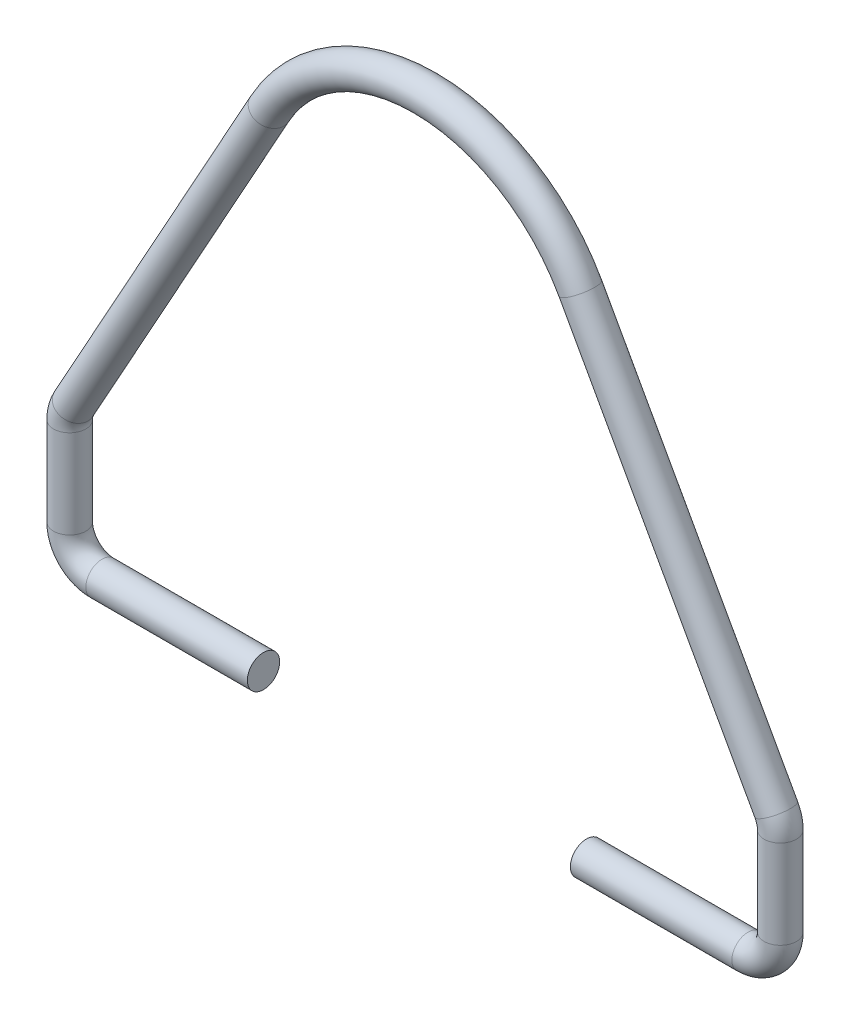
ISO-10303-21;
HEADER;
FILE_DESCRIPTION(('STEP AP214'),'2;1');
FILE_NAME('part.step','',(''),(''),'','','');
FILE_SCHEMA(('AUTOMOTIVE_DESIGN { 1 0 10303 214 1 1 1 1 }'));
ENDSEC;
DATA;
#1=APPLICATION_CONTEXT('core data for automotive mechanical design processes');
#2=APPLICATION_PROTOCOL_DEFINITION('international standard','automotive_design',2000,#1);
#3=PRODUCT_CONTEXT('',#1,'mechanical');
#4=PRODUCT('Part','Part','',(#3));
#5=PRODUCT_RELATED_PRODUCT_CATEGORY('part','',(#4));
#6=PRODUCT_DEFINITION_FORMATION('','',#4);
#7=PRODUCT_DEFINITION_CONTEXT('part definition',#1,'design');
#8=PRODUCT_DEFINITION('design','',#6,#7);
#9=PRODUCT_DEFINITION_SHAPE('','',#8);
#10=(LENGTH_UNIT() NAMED_UNIT(*) SI_UNIT(.MILLI.,.METRE.));
#11=(NAMED_UNIT(*) PLANE_ANGLE_UNIT() SI_UNIT($,.RADIAN.));
#12=(NAMED_UNIT(*) SI_UNIT($,.STERADIAN.) SOLID_ANGLE_UNIT());
#13=UNCERTAINTY_MEASURE_WITH_UNIT(LENGTH_MEASURE(1.E-05),#10,'distance_accuracy_value','');
#14=(GEOMETRIC_REPRESENTATION_CONTEXT(3) GLOBAL_UNCERTAINTY_ASSIGNED_CONTEXT((#13)) GLOBAL_UNIT_ASSIGNED_CONTEXT((#10,
#11,#12)) REPRESENTATION_CONTEXT('',''));
#15=CARTESIAN_POINT('',(0.,0.,0.));
#16=DIRECTION('',(0.,0.,1.));
#17=DIRECTION('',(1.,0.,0.));
#18=AXIS2_PLACEMENT_3D('',#15,#16,#17);
#19=CARTESIAN_POINT('',(10.,-12.5,0.));
#20=DIRECTION('',(-1.,0.,0.));
#21=DIRECTION('',(0.,0.,1.));
#22=AXIS2_PLACEMENT_3D('',#19,#20,#21);
#23=CYLINDRICAL_SURFACE('',#22,0.500000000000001);
#24=CARTESIAN_POINT('',(10.,-12.5,0.));
#25=DIRECTION('',(1.,0.,0.));
#26=DIRECTION('',(0.,0.,-1.));
#27=AXIS2_PLACEMENT_3D('',#24,#25,#26);
#28=CIRCLE('',#27,0.500000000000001);
#29=CARTESIAN_POINT('',(10.,-13.,0.));
#30=VERTEX_POINT('',#29);
#31=EDGE_CURVE('E35',#30,#30,#28,.T.);
#32=ORIENTED_EDGE('',*,*,#31,.F.);
#33=EDGE_LOOP('',(#32));
#34=FACE_BOUND('',#33,.T.);
#35=CARTESIAN_POINT('',(5.,-12.5,0.));
#36=DIRECTION('',(1.,0.,0.));
#37=DIRECTION('',(0.,0.,-1.));
#38=AXIS2_PLACEMENT_3D('',#35,#36,#37);
#39=CIRCLE('',#38,0.500000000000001);
#40=CARTESIAN_POINT('',(5.,-12.5,-0.500000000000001));
#41=VERTEX_POINT('',#40);
#42=EDGE_CURVE('E10',#41,#41,#39,.T.);
#43=ORIENTED_EDGE('',*,*,#42,.T.);
#44=EDGE_LOOP('',(#43));
#45=FACE_BOUND('',#44,.T.);
#46=ADVANCED_FACE('F29',(#34,#45),#23,.T.);
#47=CARTESIAN_POINT('',(10.,-11.5,0.));
#48=DIRECTION('',(0.,0.,-1.));
#49=DIRECTION('',(-1.,0.,0.));
#50=AXIS2_PLACEMENT_3D('',#47,#48,#49);
#51=TOROIDAL_SURFACE('',#50,1.,0.500000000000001);
#52=CARTESIAN_POINT('',(11.,-11.5,0.));
#53=DIRECTION('',(0.,1.,0.));
#54=DIRECTION('',(0.,0.,-1.));
#55=AXIS2_PLACEMENT_3D('',#52,#53,#54);
#56=CIRCLE('',#55,0.500000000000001);
#57=CARTESIAN_POINT('',(11.5,-11.5,0.));
#58=VERTEX_POINT('',#57);
#59=EDGE_CURVE('E39',#58,#58,#56,.T.);
#60=CARTESIAN_POINT('',(10.,-11.5,0.));
#61=DIRECTION('',(0.,0.,-1.));
#62=DIRECTION('',(-1.,0.,0.));
#63=AXIS2_PLACEMENT_3D('',#60,#61,#62);
#64=CIRCLE('',#63,1.5);
#65=EDGE_CURVE('',#58,#30,#64,.T.);
#66=ORIENTED_EDGE('',*,*,#59,.F.);
#67=ORIENTED_EDGE('',*,*,#31,.T.);
#68=ORIENTED_EDGE('',*,*,#65,.T.);
#69=ORIENTED_EDGE('',*,*,#65,.F.);
#70=EDGE_LOOP('',(#66,#68,#67,#69));
#71=FACE_BOUND('',#70,.T.);
#72=ADVANCED_FACE('F121',(#71),#51,.T.);
#73=CARTESIAN_POINT('',(11.,-8.75861486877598,0.));
#74=DIRECTION('',(0.,-1.,0.));
#75=DIRECTION('',(0.,0.,-1.));
#76=AXIS2_PLACEMENT_3D('',#73,#74,#75);
#77=CYLINDRICAL_SURFACE('',#76,0.500000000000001);
#78=CARTESIAN_POINT('',(11.,-8.75861486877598,0.));
#79=DIRECTION('',(0.,1.,0.));
#80=DIRECTION('',(0.,0.,-1.));
#81=AXIS2_PLACEMENT_3D('',#78,#79,#80);
#82=CIRCLE('',#81,0.500000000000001);
#83=CARTESIAN_POINT('',(11.5,-8.75861486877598,0.));
#84=VERTEX_POINT('',#83);
#85=EDGE_CURVE('E43',#84,#84,#82,.T.);
#86=ORIENTED_EDGE('',*,*,#85,.F.);
#87=EDGE_LOOP('',(#86));
#88=FACE_BOUND('',#87,.T.);
#89=ORIENTED_EDGE('',*,*,#59,.T.);
#90=EDGE_LOOP('',(#89));
#91=FACE_BOUND('',#90,.T.);
#92=ADVANCED_FACE('F115',(#88,#91),#77,.T.);
#93=CARTESIAN_POINT('',(10.,-8.75861486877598,0.));
#94=DIRECTION('',(0.,0.,-1.));
#95=DIRECTION('',(-1.,0.,0.));
#96=AXIS2_PLACEMENT_3D('',#93,#94,#95);
#97=TOROIDAL_SURFACE('',#96,0.999999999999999,0.500000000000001);
#98=CARTESIAN_POINT('',(10.8746221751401,-8.27380970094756,0.));
#99=DIRECTION('',(-0.484805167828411,0.874622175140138,0.));
#100=DIRECTION('',(0.,0.,-1.));
#101=AXIS2_PLACEMENT_3D('',#98,#99,#100);
#102=CIRCLE('',#101,0.500000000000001);
#103=CARTESIAN_POINT('',(11.3119332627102,-8.03140711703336,0.));
#104=VERTEX_POINT('',#103);
#105=EDGE_CURVE('E48',#104,#104,#102,.T.);
#106=CARTESIAN_POINT('',(10.,-8.75861486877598,0.));
#107=DIRECTION('',(0.,0.,-1.));
#108=DIRECTION('',(-1.,0.,0.));
#109=AXIS2_PLACEMENT_3D('',#106,#107,#108);
#110=CIRCLE('',#109,1.5);
#111=EDGE_CURVE('',#104,#84,#110,.T.);
#112=ORIENTED_EDGE('',*,*,#105,.F.);
#113=ORIENTED_EDGE('',*,*,#85,.T.);
#114=ORIENTED_EDGE('',*,*,#111,.T.);
#115=ORIENTED_EDGE('',*,*,#111,.F.);
#116=EDGE_LOOP('',(#112,#114,#113,#115));
#117=FACE_BOUND('',#116,.T.);
#118=ADVANCED_FACE('F109',(#117),#97,.T.);
#119=CARTESIAN_POINT('',(4.81042196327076,2.66642842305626,0.));
#120=DIRECTION('',(0.484805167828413,-0.874622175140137,0.));
#121=DIRECTION('',(0.874622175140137,0.484805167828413,0.));
#122=AXIS2_PLACEMENT_3D('',#119,#120,#121);
#123=CYLINDRICAL_SURFACE('',#122,0.500000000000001);
#124=CARTESIAN_POINT('',(4.81042196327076,2.66642842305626,0.));
#125=DIRECTION('',(-0.484805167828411,0.874622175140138,0.));
#126=DIRECTION('',(0.,0.,-1.));
#127=AXIS2_PLACEMENT_3D('',#124,#125,#126);
#128=CIRCLE('',#127,0.500000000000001);
#129=CARTESIAN_POINT('',(5.24773305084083,2.90883100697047,0.));
#130=VERTEX_POINT('',#129);
#131=EDGE_CURVE('E51',#130,#130,#128,.T.);
#132=ORIENTED_EDGE('',*,*,#131,.F.);
#133=EDGE_LOOP('',(#132));
#134=FACE_BOUND('',#133,.T.);
#135=ORIENTED_EDGE('',*,*,#105,.T.);
#136=EDGE_LOOP('',(#135));
#137=FACE_BOUND('',#136,.T.);
#138=ADVANCED_FACE('F103',(#134,#137),#123,.T.);
#139=CARTESIAN_POINT('',(0.,0.,0.));
#140=DIRECTION('',(0.,0.,-1.));
#141=DIRECTION('',(-1.,0.,0.));
#142=AXIS2_PLACEMENT_3D('',#139,#140,#141);
#143=TOROIDAL_SURFACE('',#142,5.5,0.500000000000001);
#144=CARTESIAN_POINT('',(-4.81042196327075,2.66642842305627,0.));
#145=DIRECTION('',(-0.484805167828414,-0.874622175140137,0.));
#146=DIRECTION('',(0.,0.,-1.));
#147=AXIS2_PLACEMENT_3D('',#144,#145,#146);
#148=CIRCLE('',#147,0.500000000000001);
#149=CARTESIAN_POINT('',(-5.24773305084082,2.90883100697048,0.));
#150=VERTEX_POINT('',#149);
#151=EDGE_CURVE('E54',#150,#150,#148,.T.);
#152=CARTESIAN_POINT('',(0.,0.,0.));
#153=DIRECTION('',(0.,0.,-1.));
#154=DIRECTION('',(-1.,0.,0.));
#155=AXIS2_PLACEMENT_3D('',#152,#153,#154);
#156=CIRCLE('',#155,6.);
#157=EDGE_CURVE('',#150,#130,#156,.T.);
#158=ORIENTED_EDGE('',*,*,#151,.F.);
#159=ORIENTED_EDGE('',*,*,#131,.T.);
#160=ORIENTED_EDGE('',*,*,#157,.T.);
#161=ORIENTED_EDGE('',*,*,#157,.F.);
#162=EDGE_LOOP('',(#158,#160,#159,#161));
#163=FACE_BOUND('',#162,.T.);
#164=ADVANCED_FACE('F97',(#163),#143,.T.);
#165=CARTESIAN_POINT('',(-10.8746221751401,-8.27380970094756,0.));
#166=DIRECTION('',(0.484805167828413,0.874622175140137,0.));
#167=DIRECTION('',(-0.874622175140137,0.484805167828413,0.));
#168=AXIS2_PLACEMENT_3D('',#165,#166,#167);
#169=CYLINDRICAL_SURFACE('',#168,0.500000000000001);
#170=CARTESIAN_POINT('',(-10.8746221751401,-8.27380970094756,0.));
#171=DIRECTION('',(-0.484805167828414,-0.874622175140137,0.));
#172=DIRECTION('',(0.,0.,-1.));
#173=AXIS2_PLACEMENT_3D('',#170,#171,#172);
#174=CIRCLE('',#173,0.500000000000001);
#175=CARTESIAN_POINT('',(-11.3119332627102,-8.03140711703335,0.));
#176=VERTEX_POINT('',#175);
#177=EDGE_CURVE('E57',#176,#176,#174,.T.);
#178=ORIENTED_EDGE('',*,*,#177,.F.);
#179=EDGE_LOOP('',(#178));
#180=FACE_BOUND('',#179,.T.);
#181=ORIENTED_EDGE('',*,*,#151,.T.);
#182=EDGE_LOOP('',(#181));
#183=FACE_BOUND('',#182,.T.);
#184=ADVANCED_FACE('F91',(#180,#183),#169,.T.);
#185=CARTESIAN_POINT('',(-9.99999999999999,-8.75861486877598,0.));
#186=DIRECTION('',(0.,0.,-1.));
#187=DIRECTION('',(-1.,0.,0.));
#188=AXIS2_PLACEMENT_3D('',#185,#186,#187);
#189=TOROIDAL_SURFACE('',#188,0.999999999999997,0.500000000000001);
#190=CARTESIAN_POINT('',(-11.,-8.75861486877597,0.));
#191=DIRECTION('',(0.,-1.,0.));
#192=DIRECTION('',(0.,0.,-1.));
#193=AXIS2_PLACEMENT_3D('',#190,#191,#192);
#194=CIRCLE('',#193,0.500000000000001);
#195=CARTESIAN_POINT('',(-11.5,-8.75861486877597,0.));
#196=VERTEX_POINT('',#195);
#197=EDGE_CURVE('E60',#196,#196,#194,.T.);
#198=CARTESIAN_POINT('',(-9.99999999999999,-8.75861486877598,0.));
#199=DIRECTION('',(0.,0.,-1.));
#200=DIRECTION('',(-1.,0.,0.));
#201=AXIS2_PLACEMENT_3D('',#198,#199,#200);
#202=CIRCLE('',#201,1.5);
#203=EDGE_CURVE('',#196,#176,#202,.T.);
#204=ORIENTED_EDGE('',*,*,#197,.F.);
#205=ORIENTED_EDGE('',*,*,#177,.T.);
#206=ORIENTED_EDGE('',*,*,#203,.T.);
#207=ORIENTED_EDGE('',*,*,#203,.F.);
#208=EDGE_LOOP('',(#204,#206,#205,#207));
#209=FACE_BOUND('',#208,.T.);
#210=ADVANCED_FACE('F85',(#209),#189,.T.);
#211=CARTESIAN_POINT('',(-11.,-11.5,0.));
#212=DIRECTION('',(0.,1.,0.));
#213=DIRECTION('',(-1.,0.,0.));
#214=AXIS2_PLACEMENT_3D('',#211,#212,#213);
#215=CYLINDRICAL_SURFACE('',#214,0.500000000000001);
#216=CARTESIAN_POINT('',(-11.,-11.5,0.));
#217=DIRECTION('',(0.,-1.,0.));
#218=DIRECTION('',(0.,0.,-1.));
#219=AXIS2_PLACEMENT_3D('',#216,#217,#218);
#220=CIRCLE('',#219,0.500000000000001);
#221=CARTESIAN_POINT('',(-11.5,-11.5,0.));
#222=VERTEX_POINT('',#221);
#223=EDGE_CURVE('E63',#222,#222,#220,.T.);
#224=ORIENTED_EDGE('',*,*,#223,.F.);
#225=EDGE_LOOP('',(#224));
#226=FACE_BOUND('',#225,.T.);
#227=ORIENTED_EDGE('',*,*,#197,.T.);
#228=EDGE_LOOP('',(#227));
#229=FACE_BOUND('',#228,.T.);
#230=ADVANCED_FACE('F79',(#226,#229),#215,.T.);
#231=CARTESIAN_POINT('',(-9.99999999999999,-11.5,0.));
#232=DIRECTION('',(0.,0.,-1.));
#233=DIRECTION('',(-1.,0.,0.));
#234=AXIS2_PLACEMENT_3D('',#231,#232,#233);
#235=TOROIDAL_SURFACE('',#234,1.,0.500000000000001);
#236=CARTESIAN_POINT('',(-9.99999999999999,-12.5,0.));
#237=DIRECTION('',(1.,0.,0.));
#238=DIRECTION('',(0.,0.,-1.));
#239=AXIS2_PLACEMENT_3D('',#236,#237,#238);
#240=CIRCLE('',#239,0.500000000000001);
#241=CARTESIAN_POINT('',(-9.99999999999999,-13.,0.));
#242=VERTEX_POINT('',#241);
#243=EDGE_CURVE('E66',#242,#242,#240,.T.);
#244=CARTESIAN_POINT('',(-9.99999999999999,-11.5,0.));
#245=DIRECTION('',(0.,0.,-1.));
#246=DIRECTION('',(-1.,0.,0.));
#247=AXIS2_PLACEMENT_3D('',#244,#245,#246);
#248=CIRCLE('',#247,1.5);
#249=EDGE_CURVE('',#242,#222,#248,.T.);
#250=ORIENTED_EDGE('',*,*,#243,.F.);
#251=ORIENTED_EDGE('',*,*,#223,.T.);
#252=ORIENTED_EDGE('',*,*,#249,.T.);
#253=ORIENTED_EDGE('',*,*,#249,.F.);
#254=EDGE_LOOP('',(#250,#252,#251,#253));
#255=FACE_BOUND('',#254,.T.);
#256=ADVANCED_FACE('F76',(#255),#235,.T.);
#257=CARTESIAN_POINT('',(-9.99999999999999,-12.5,0.));
#258=DIRECTION('',(1.,0.,0.));
#259=DIRECTION('',(0.,0.,-1.));
#260=AXIS2_PLACEMENT_3D('',#257,#258,#259);
#261=CYLINDRICAL_SURFACE('',#260,0.500000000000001);
#262=ORIENTED_EDGE('',*,*,#243,.T.);
#263=EDGE_LOOP('',(#262));
#264=FACE_BOUND('',#263,.T.);
#265=CARTESIAN_POINT('',(-5.,-12.5,0.));
#266=DIRECTION('',(1.,0.,0.));
#267=DIRECTION('',(0.,0.,-1.));
#268=AXIS2_PLACEMENT_3D('',#265,#266,#267);
#269=CIRCLE('',#268,0.500000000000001);
#270=CARTESIAN_POINT('',(-5.,-12.5,-0.500000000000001));
#271=VERTEX_POINT('',#270);
#272=EDGE_CURVE('E67',#271,#271,#269,.T.);
#273=ORIENTED_EDGE('',*,*,#272,.F.);
#274=EDGE_LOOP('',(#273));
#275=FACE_BOUND('',#274,.T.);
#276=ADVANCED_FACE('F73',(#264,#275),#261,.T.);
#277=CARTESIAN_POINT('',(5.,-12.5,0.));
#278=DIRECTION('',(1.,0.,0.));
#279=DIRECTION('',(0.,0.,-1.));
#280=AXIS2_PLACEMENT_3D('',#277,#278,#279);
#281=PLANE('',#280);
#282=ORIENTED_EDGE('',*,*,#42,.F.);
#283=EDGE_LOOP('',(#282));
#284=FACE_BOUND('',#283,.T.);
#285=ADVANCED_FACE('F133',(#284),#281,.F.);
#286=CARTESIAN_POINT('',(-5.,-12.5,0.));
#287=DIRECTION('',(1.,0.,0.));
#288=DIRECTION('',(0.,0.,-1.));
#289=AXIS2_PLACEMENT_3D('',#286,#287,#288);
#290=PLANE('',#289);
#291=ORIENTED_EDGE('',*,*,#272,.T.);
#292=EDGE_LOOP('',(#291));
#293=FACE_BOUND('',#292,.T.);
#294=ADVANCED_FACE('F134',(#293),#290,.T.);
#295=CLOSED_SHELL('',(#46,#72,#92,#118,#138,#164,#184,#210,#230,#256,#276,#285,#294));
#296=MANIFOLD_SOLID_BREP('B2',#295);
#297=ADVANCED_BREP_SHAPE_REPRESENTATION('',(#18,#296),#14);
#298=SHAPE_DEFINITION_REPRESENTATION(#9,#297);
ENDSEC;
END-ISO-10303-21;
